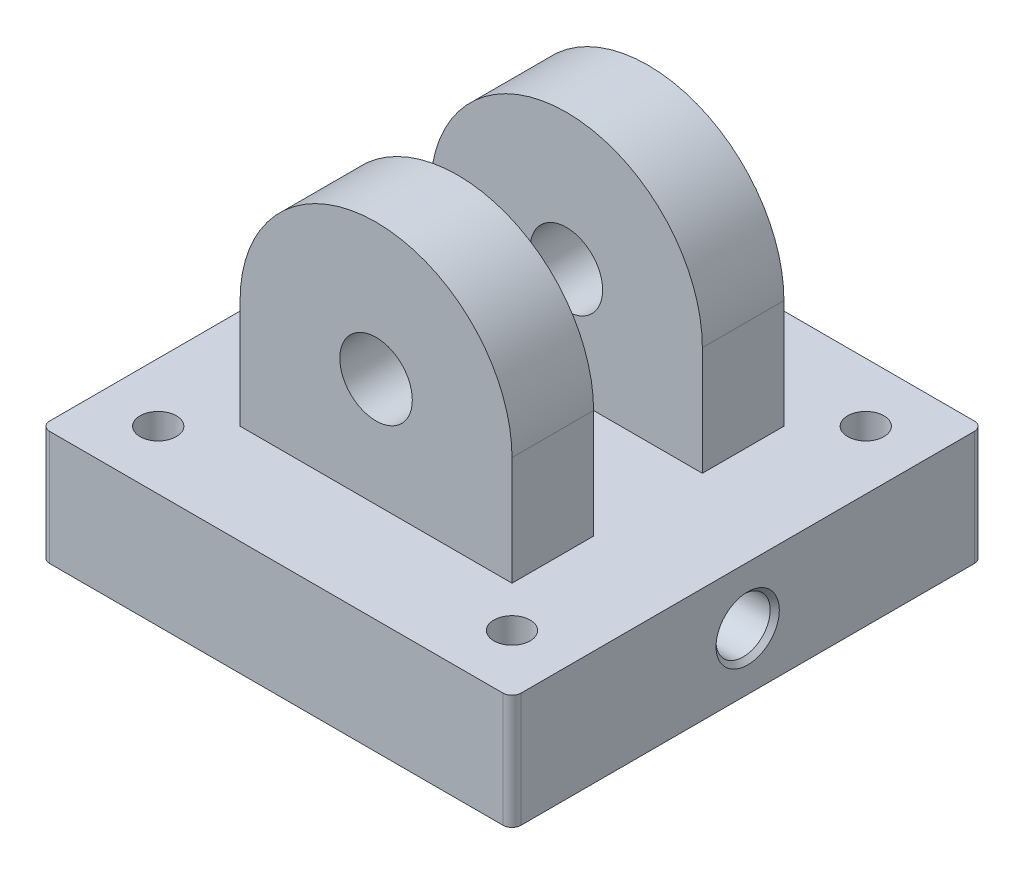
from build123d import *

# Parameters (mm, degrees)
BOSS_EXTRUDE2_DEPTH                    = 38.1
BOSS_EXTRUDE2_DEPTH_BACK               = 2
SKETCH4_W                              = 165.1
SKETCH4_H                              = 165.1
SKETCH5_W                              = 95.25
SKETCH5_H                              = 95.25
BOSS_EXTRUDE3_DEPTH                    = 38.1
BOSS_EXTRUDE4_START                    = -95.25
BOSS_EXTRUDE4_DEPTH                    = 95.25
SKETCH7_R                              = 12.7
CUT_EXTRUDE1_DEPTH                     = 198.718647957
SKETCH8_W                              = 38.1
SKETCH8_H                              = 85.725
CUT_EXTRUDE2_DEPTH                     = 198.718647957
FILLET1_R                              = 3.175
SKETCH9_R                              = 26
CUT_EXTRUDE3_DEPTH                     = 36.83
SKETCH10_R                             = 76.2
SKETCH10_R_2                           = 69.85
CUT_EXTRUDE4_DEPTH                     = 8
F_1_2_14_NPSM_TAPPED_HOLE1_D           = 18.9738
F_1_2_14_NPSM_TAPPED_HOLE1_DEPTH       = 63.5
F_1_2_14_NPSM_TAPPED_HOLE1_CSINK_D     = 22.1742
F_1_2_14_NPSM_TAPPED_HOLE1_CSINK_ANGLE = 90
F_1_2_14_NPSM_TAPPED_HOLE1_TIP         = 5.700304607
SKETCH16_R                             = 6.35
CUT_EXTRUDE5_DEPTH                     = 25
SKETCH17_R                             = 6.35
CUT_EXTRUDE6_DEPTH                     = 172.641881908


with BuildPart() as part:
    # Sketch4 → Boss-Extrude2 (new, two sides: drawn at the far end of the back side and taken through both)
    with BuildSketch(Plane(origin=(0, 0, 0), x_dir=(1, 0, 0), z_dir=(0, 1, 0)).offset(-BOSS_EXTRUDE2_DEPTH_BACK)):
        Rectangle(SKETCH4_W, SKETCH4_H)
    extrude(amount=BOSS_EXTRUDE2_DEPTH + BOSS_EXTRUDE2_DEPTH_BACK)

    # Sketch5 → Boss-Extrude3 (add)
    with BuildSketch(Plane(origin=(0, 38.1, 0), x_dir=(1, 0, 0), z_dir=(0, 1, 0))):
        Rectangle(SKETCH5_W, SKETCH5_H)
    extrude(amount=BOSS_EXTRUDE3_DEPTH)

    # Sketch6 → Boss-Extrude4 (add)
    with BuildSketch(Plane.XY.offset(47.625).offset(BOSS_EXTRUDE4_START)):
        with BuildLine():
            Line((-47.625, 76.2), (47.625, 76.2))
            ThreePointArc((47.625, 76.2), (0, 123.825), (-47.625, 76.2))
        make_face()
    extrude(amount=BOSS_EXTRUDE4_DEPTH)

    # Sketch7 → Cut-Extrude1 (cut, through all)
    with BuildSketch(Plane.XY.offset(47.625)):
        with Locations((0, 76.2)):
            Circle(SKETCH7_R)
    extrude(amount=-CUT_EXTRUDE1_DEPTH, mode=Mode.SUBTRACT)

    # Sketch8 → Cut-Extrude2 (cut, through all)
    with BuildSketch(Plane(origin=(47.625, 0, 0), x_dir=(0, 0, -1), z_dir=(1, 0, 0))):
        with Locations((0, 80.9625)):
            Rectangle(SKETCH8_W, SKETCH8_H)
    extrude(amount=-CUT_EXTRUDE2_DEPTH, mode=Mode.SUBTRACT)

    # Fillet1
    fillet1_edges = [part.edges().sort_by_distance(p)[0] for p in [
        (82.55, 18.05, 82.55),
        (-82.55, 18.05, 82.55),
        (-82.55, 18.05, -82.55),
        (82.55, 18.05, -82.55),
    ]]
    fillet(fillet1_edges, radius=FILLET1_R)

    # Sketch9 → Cut-Extrude3 (cut)
    with BuildSketch(Plane.XZ.offset(2)):
        with Locations(Location((0, 0, 0), (0, 0, 270))):
            Circle(SKETCH9_R)
    extrude(amount=-CUT_EXTRUDE3_DEPTH, mode=Mode.SUBTRACT)

    # Sketch10 → Cut-Extrude4 (cut)
    with BuildSketch(Plane.XZ.offset(2)):
        with Locations(Location((0, 0, 0), (0, 0, 270))):
            Circle(SKETCH10_R)
        with Locations(Location((0, 0, 0), (0, 0, 270))):
            Circle(SKETCH10_R_2, mode=Mode.SUBTRACT)
    extrude(amount=-CUT_EXTRUDE4_DEPTH, mode=Mode.SUBTRACT)

    # 1_2-14 NPSM Tapped Hole1
    with Locations(Plane(origin=(82.55, 0, 0), x_dir=(0, 0, -1), z_dir=(1, 0, 0))):
        with Locations((0, 18.05)):
            CounterSinkHole(F_1_2_14_NPSM_TAPPED_HOLE1_D / 2, F_1_2_14_NPSM_TAPPED_HOLE1_CSINK_D / 2, depth=F_1_2_14_NPSM_TAPPED_HOLE1_DEPTH, counter_sink_angle=F_1_2_14_NPSM_TAPPED_HOLE1_CSINK_ANGLE)
            with Locations((0, 0, -(F_1_2_14_NPSM_TAPPED_HOLE1_DEPTH + F_1_2_14_NPSM_TAPPED_HOLE1_TIP / 2))):  # 118° drill point
                Cone(0, F_1_2_14_NPSM_TAPPED_HOLE1_D / 2, F_1_2_14_NPSM_TAPPED_HOLE1_TIP, mode=Mode.SUBTRACT)

    # Sketch16 → Cut-Extrude5 (cut)
    with BuildSketch(Plane.XZ.offset(2)):
        with Locations(Location((50.55, 0, 0), (0, 0, 270))):
            Circle(SKETCH16_R)
    extrude(amount=-CUT_EXTRUDE5_DEPTH, mode=Mode.SUBTRACT)

    # Sketch17 → Cut-Extrude6 (cut, through all)
    with BuildSketch(Plane.XZ.offset(2)):
        with Locations(Location((-61.963767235, 61.963767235, 0), (0, 0, 270))):
            Circle(SKETCH17_R)
        with Locations(Location((61.963767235, 61.963767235, 0), (0, 0, 270))):
            Circle(SKETCH17_R)
        with Locations(Location((61.963767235, -61.963767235, 0), (0, 0, 270))):
            Circle(SKETCH17_R)
        with Locations(Location((-61.963767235, -61.963767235, 0), (0, 0, 270))):
            Circle(SKETCH17_R)
    extrude(amount=-CUT_EXTRUDE6_DEPTH, mode=Mode.SUBTRACT)


solid = part.part
